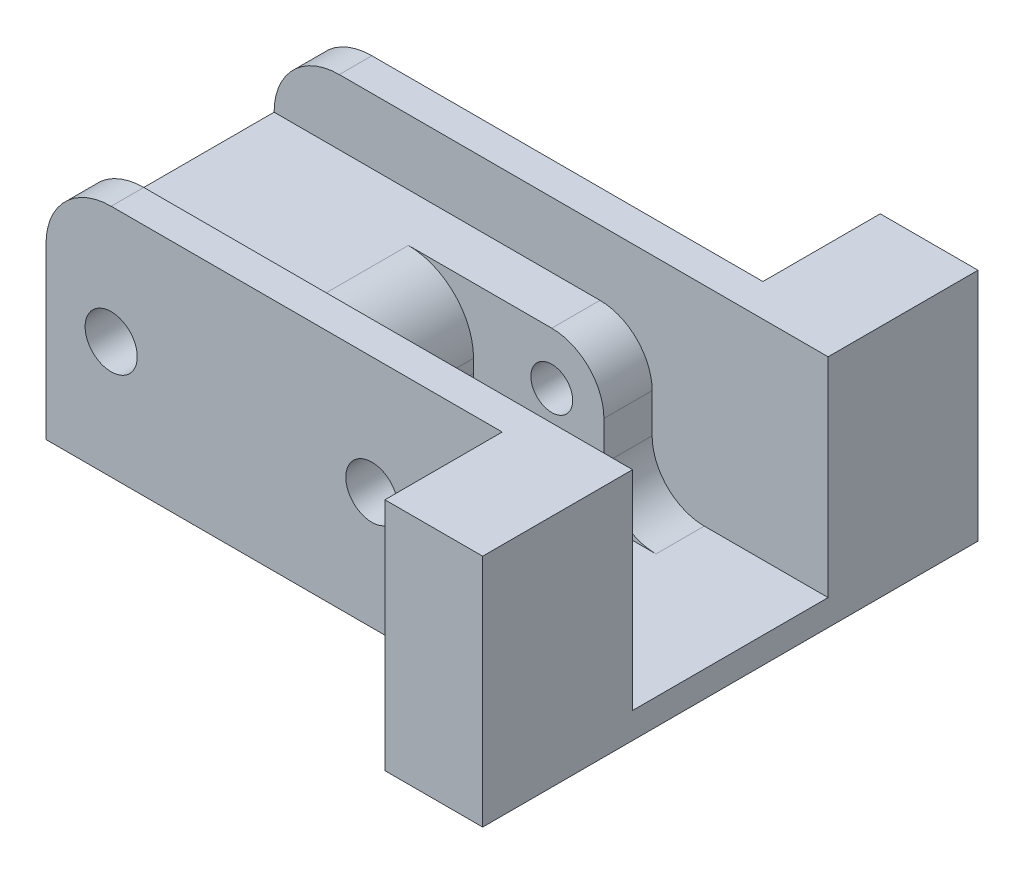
ISO-10303-21;
HEADER;
FILE_DESCRIPTION(('STEP AP214'),'2;1');
FILE_NAME('part.step','',(''),(''),'','','');
FILE_SCHEMA(('AUTOMOTIVE_DESIGN { 1 0 10303 214 1 1 1 1 }'));
ENDSEC;
DATA;
#1=APPLICATION_CONTEXT('core data for automotive mechanical design processes');
#2=APPLICATION_PROTOCOL_DEFINITION('international standard','automotive_design',2000,#1);
#3=PRODUCT_CONTEXT('',#1,'mechanical');
#4=PRODUCT('Part','Part','',(#3));
#5=PRODUCT_RELATED_PRODUCT_CATEGORY('part','',(#4));
#6=PRODUCT_DEFINITION_FORMATION('','',#4);
#7=PRODUCT_DEFINITION_CONTEXT('part definition',#1,'design');
#8=PRODUCT_DEFINITION('design','',#6,#7);
#9=PRODUCT_DEFINITION_SHAPE('','',#8);
#10=(LENGTH_UNIT() NAMED_UNIT(*) SI_UNIT(.MILLI.,.METRE.));
#11=(NAMED_UNIT(*) PLANE_ANGLE_UNIT() SI_UNIT($,.RADIAN.));
#12=(NAMED_UNIT(*) SI_UNIT($,.STERADIAN.) SOLID_ANGLE_UNIT());
#13=UNCERTAINTY_MEASURE_WITH_UNIT(LENGTH_MEASURE(1.E-05),#10,'distance_accuracy_value','');
#14=(GEOMETRIC_REPRESENTATION_CONTEXT(3) GLOBAL_UNCERTAINTY_ASSIGNED_CONTEXT((#13)) GLOBAL_UNIT_ASSIGNED_CONTEXT((#10,
#11,#12)) REPRESENTATION_CONTEXT('',''));
#15=CARTESIAN_POINT('',(0.,0.,0.));
#16=DIRECTION('',(0.,0.,1.));
#17=DIRECTION('',(1.,0.,0.));
#18=AXIS2_PLACEMENT_3D('',#15,#16,#17);
#19=CARTESIAN_POINT('',(0.,0.,10.));
#20=DIRECTION('',(0.,0.,-1.));
#21=DIRECTION('',(-1.,0.,0.));
#22=AXIS2_PLACEMENT_3D('',#19,#20,#21);
#23=CYLINDRICAL_SURFACE('',#22,1.605);
#24=CARTESIAN_POINT('',(0.,0.,5.));
#25=DIRECTION('',(0.,0.,1.));
#26=DIRECTION('',(1.,0.,0.));
#27=AXIS2_PLACEMENT_3D('',#24,#25,#26);
#28=CIRCLE('',#27,1.605);
#29=CARTESIAN_POINT('',(1.605,0.,5.));
#30=VERTEX_POINT('',#29);
#31=EDGE_CURVE('E421',#30,#30,#28,.T.);
#32=ORIENTED_EDGE('',*,*,#31,.T.);
#33=EDGE_LOOP('',(#32));
#34=FACE_BOUND('',#33,.T.);
#35=CARTESIAN_POINT('',(0.,0.,-5.));
#36=DIRECTION('',(0.,0.,-1.));
#37=DIRECTION('',(-1.,0.,0.));
#38=AXIS2_PLACEMENT_3D('',#35,#36,#37);
#39=CIRCLE('',#38,1.605);
#40=CARTESIAN_POINT('',(-1.605,0.,-5.));
#41=VERTEX_POINT('',#40);
#42=EDGE_CURVE('E47',#41,#41,#39,.T.);
#43=ORIENTED_EDGE('',*,*,#42,.T.);
#44=EDGE_LOOP('',(#43));
#45=FACE_BOUND('',#44,.T.);
#46=ADVANCED_FACE('F43',(#34,#45),#23,.F.);
#47=CARTESIAN_POINT('',(20.,0.,10.));
#48=DIRECTION('',(0.,0.,-1.));
#49=DIRECTION('',(-1.,0.,0.));
#50=AXIS2_PLACEMENT_3D('',#47,#48,#49);
#51=CYLINDRICAL_SURFACE('',#50,1.605);
#52=CARTESIAN_POINT('',(20.,0.,3.8));
#53=DIRECTION('',(0.,0.,1.));
#54=DIRECTION('',(1.,0.,0.));
#55=AXIS2_PLACEMENT_3D('',#52,#53,#54);
#56=CIRCLE('',#55,1.605);
#57=CARTESIAN_POINT('',(21.605,0.,3.8));
#58=VERTEX_POINT('',#57);
#59=EDGE_CURVE('E323',#58,#58,#56,.T.);
#60=ORIENTED_EDGE('',*,*,#59,.F.);
#61=EDGE_LOOP('',(#60));
#62=FACE_BOUND('',#61,.T.);
#63=CARTESIAN_POINT('',(20.,0.,5.));
#64=DIRECTION('',(0.,0.,1.));
#65=DIRECTION('',(1.,0.,0.));
#66=AXIS2_PLACEMENT_3D('',#63,#64,#65);
#67=CIRCLE('',#66,1.605);
#68=CARTESIAN_POINT('',(21.605,0.,5.));
#69=VERTEX_POINT('',#68);
#70=EDGE_CURVE('E233',#69,#69,#67,.T.);
#71=ORIENTED_EDGE('',*,*,#70,.T.);
#72=EDGE_LOOP('',(#71));
#73=FACE_BOUND('',#72,.T.);
#74=ADVANCED_FACE('F427',(#62,#73),#51,.F.);
#75=CARTESIAN_POINT('',(-5.,4.,10.));
#76=DIRECTION('',(0.,-1.,0.));
#77=DIRECTION('',(0.,0.,-1.));
#78=AXIS2_PLACEMENT_3D('',#75,#76,#77);
#79=PLANE('',#78);
#80=DIRECTION('',(1.,0.,0.));
#81=VECTOR('',#80,1.);
#82=CARTESIAN_POINT('',(37.5,4.,-7.5));
#83=LINE('',#82,#81);
#84=CARTESIAN_POINT('',(-5.,4.,-7.5));
#85=VERTEX_POINT('',#84);
#86=CARTESIAN_POINT('',(20.,4.,-7.5));
#87=VERTEX_POINT('',#86);
#88=EDGE_CURVE('E236',#85,#87,#83,.T.);
#89=ORIENTED_EDGE('',*,*,#88,.F.);
#90=DIRECTION('',(0.,0.,-1.));
#91=VECTOR('',#90,1.);
#92=CARTESIAN_POINT('',(-5.,4.,10.));
#93=LINE('',#92,#91);
#94=CARTESIAN_POINT('',(-5.,4.,7.5));
#95=VERTEX_POINT('',#94);
#96=EDGE_CURVE('E330',#95,#85,#93,.T.);
#97=ORIENTED_EDGE('',*,*,#96,.F.);
#98=DIRECTION('',(-1.,0.,0.));
#99=VECTOR('',#98,1.);
#100=CARTESIAN_POINT('',(37.5,4.,7.5));
#101=LINE('',#100,#99);
#102=CARTESIAN_POINT('',(20.,4.,7.5));
#103=VERTEX_POINT('',#102);
#104=EDGE_CURVE('E240',#103,#95,#101,.T.);
#105=ORIENTED_EDGE('',*,*,#104,.F.);
#106=DIRECTION('',(0.,0.,-1.));
#107=VECTOR('',#106,1.);
#108=CARTESIAN_POINT('',(20.,4.,10.));
#109=LINE('',#108,#107);
#110=CARTESIAN_POINT('',(20.,4.,3.8));
#111=VERTEX_POINT('',#110);
#112=EDGE_CURVE('E387',#103,#111,#109,.T.);
#113=ORIENTED_EDGE('',*,*,#112,.T.);
#114=DIRECTION('',(1.,0.,0.));
#115=VECTOR('',#114,1.);
#116=CARTESIAN_POINT('',(14.,4.,3.8));
#117=LINE('',#116,#115);
#118=CARTESIAN_POINT('',(9.,4.,3.8));
#119=VERTEX_POINT('',#118);
#120=EDGE_CURVE('E301',#119,#111,#117,.T.);
#121=ORIENTED_EDGE('',*,*,#120,.F.);
#122=DIRECTION('',(0.,0.,1.));
#123=VECTOR('',#122,1.);
#124=CARTESIAN_POINT('',(9.,4.,10.));
#125=LINE('',#124,#123);
#126=CARTESIAN_POINT('',(9.,4.,-3.8));
#127=VERTEX_POINT('',#126);
#128=EDGE_CURVE('E353',#119,#127,#125,.F.);
#129=ORIENTED_EDGE('',*,*,#128,.T.);
#130=DIRECTION('',(-1.,0.,0.));
#131=VECTOR('',#130,1.);
#132=CARTESIAN_POINT('',(14.,4.,-3.8));
#133=LINE('',#132,#131);
#134=CARTESIAN_POINT('',(20.,4.,-3.8));
#135=VERTEX_POINT('',#134);
#136=EDGE_CURVE('E296',#135,#127,#133,.T.);
#137=ORIENTED_EDGE('',*,*,#136,.F.);
#138=DIRECTION('',(0.,0.,-1.));
#139=VECTOR('',#138,1.);
#140=CARTESIAN_POINT('',(20.,4.,10.));
#141=LINE('',#140,#139);
#142=EDGE_CURVE('E390',#135,#87,#141,.T.);
#143=ORIENTED_EDGE('',*,*,#142,.T.);
#144=EDGE_LOOP('',(#89,#97,#105,#113,#121,#129,#137,#143));
#145=FACE_BOUND('',#144,.T.);
#146=ADVANCED_FACE('F472',(#145),#79,.F.);
#147=CARTESIAN_POINT('',(24.,-7.,10.));
#148=DIRECTION('',(0.,-1.,0.));
#149=DIRECTION('',(0.,0.,-1.));
#150=AXIS2_PLACEMENT_3D('',#147,#148,#149);
#151=PLANE('',#150);
#152=DIRECTION('',(1.,0.,0.));
#153=VECTOR('',#152,1.);
#154=CARTESIAN_POINT('',(14.,-7.,3.8));
#155=LINE('',#154,#153);
#156=CARTESIAN_POINT('',(19.,-7.,3.8));
#157=VERTEX_POINT('',#156);
#158=CARTESIAN_POINT('',(28.,-7.,3.8));
#159=VERTEX_POINT('',#158);
#160=EDGE_CURVE('E300',#157,#159,#155,.T.);
#161=ORIENTED_EDGE('',*,*,#160,.T.);
#162=DIRECTION('',(0.,0.,-1.));
#163=VECTOR('',#162,1.);
#164=CARTESIAN_POINT('',(28.,-7.,7.5));
#165=LINE('',#164,#163);
#166=CARTESIAN_POINT('',(28.,-7.,7.5));
#167=VERTEX_POINT('',#166);
#168=EDGE_CURVE('E376',#159,#167,#165,.F.);
#169=ORIENTED_EDGE('',*,*,#168,.T.);
#170=DIRECTION('',(-1.,0.,0.));
#171=VECTOR('',#170,1.);
#172=CARTESIAN_POINT('',(24.,-7.,7.5));
#173=LINE('',#172,#171);
#174=CARTESIAN_POINT('',(37.5,-7.,7.5));
#175=VERTEX_POINT('',#174);
#176=EDGE_CURVE('E285',#175,#167,#173,.T.);
#177=ORIENTED_EDGE('',*,*,#176,.F.);
#178=DIRECTION('',(0.,0.,-1.));
#179=VECTOR('',#178,1.);
#180=CARTESIAN_POINT('',(37.5,-7.,10.));
#181=LINE('',#180,#179);
#182=CARTESIAN_POINT('',(37.5,-7.,-7.5));
#183=VERTEX_POINT('',#182);
#184=EDGE_CURVE('E336',#175,#183,#181,.T.);
#185=ORIENTED_EDGE('',*,*,#184,.T.);
#186=DIRECTION('',(1.,0.,0.));
#187=VECTOR('',#186,1.);
#188=CARTESIAN_POINT('',(24.,-7.,-7.5));
#189=LINE('',#188,#187);
#190=CARTESIAN_POINT('',(28.,-7.,-7.5));
#191=VERTEX_POINT('',#190);
#192=EDGE_CURVE('E288',#191,#183,#189,.T.);
#193=ORIENTED_EDGE('',*,*,#192,.F.);
#194=DIRECTION('',(0.,0.,-1.));
#195=VECTOR('',#194,1.);
#196=CARTESIAN_POINT('',(28.,-7.,-3.8));
#197=LINE('',#196,#195);
#198=CARTESIAN_POINT('',(28.,-7.,-3.8));
#199=VERTEX_POINT('',#198);
#200=EDGE_CURVE('E373',#191,#199,#197,.F.);
#201=ORIENTED_EDGE('',*,*,#200,.T.);
#202=DIRECTION('',(-1.,0.,0.));
#203=VECTOR('',#202,1.);
#204=CARTESIAN_POINT('',(14.,-7.,-3.8));
#205=LINE('',#204,#203);
#206=CARTESIAN_POINT('',(19.,-7.,-3.8));
#207=VERTEX_POINT('',#206);
#208=EDGE_CURVE('E297',#199,#207,#205,.T.);
#209=ORIENTED_EDGE('',*,*,#208,.T.);
#210=DIRECTION('',(0.,0.,1.));
#211=VECTOR('',#210,1.);
#212=CARTESIAN_POINT('',(19.,-7.,3.8));
#213=LINE('',#212,#211);
#214=EDGE_CURVE('E356',#207,#157,#213,.T.);
#215=ORIENTED_EDGE('',*,*,#214,.T.);
#216=EDGE_LOOP('',(#161,#169,#177,#185,#193,#201,#209,#215));
#217=FACE_BOUND('',#216,.T.);
#218=ADVANCED_FACE('F499',(#217),#151,.F.);
#219=CARTESIAN_POINT('',(24.,4.,10.));
#220=DIRECTION('',(-1.,0.,0.));
#221=DIRECTION('',(0.,0.,1.));
#222=AXIS2_PLACEMENT_3D('',#219,#220,#221);
#223=PLANE('',#222);
#224=DIRECTION('',(0.,-1.,0.));
#225=VECTOR('',#224,1.);
#226=CARTESIAN_POINT('',(24.,4.,7.5));
#227=LINE('',#226,#225);
#228=CARTESIAN_POINT('',(24.,0.,7.5));
#229=VERTEX_POINT('',#228);
#230=CARTESIAN_POINT('',(24.,-3.,7.5));
#231=VERTEX_POINT('',#230);
#232=EDGE_CURVE('E282',#229,#231,#227,.T.);
#233=ORIENTED_EDGE('',*,*,#232,.T.);
#234=DIRECTION('',(0.,0.,-1.));
#235=VECTOR('',#234,1.);
#236=CARTESIAN_POINT('',(24.,-3.,3.8));
#237=LINE('',#236,#235);
#238=CARTESIAN_POINT('',(24.,-3.,3.8));
#239=VERTEX_POINT('',#238);
#240=EDGE_CURVE('E370',#231,#239,#237,.T.);
#241=ORIENTED_EDGE('',*,*,#240,.T.);
#242=DIRECTION('',(0.,1.,0.));
#243=VECTOR('',#242,1.);
#244=CARTESIAN_POINT('',(24.,-7.,3.8));
#245=LINE('',#244,#243);
#246=CARTESIAN_POINT('',(24.,0.,3.8));
#247=VERTEX_POINT('',#246);
#248=EDGE_CURVE('E307',#239,#247,#245,.T.);
#249=ORIENTED_EDGE('',*,*,#248,.T.);
#250=DIRECTION('',(0.,0.,-1.));
#251=VECTOR('',#250,1.);
#252=CARTESIAN_POINT('',(24.,0.,10.));
#253=LINE('',#252,#251);
#254=EDGE_CURVE('E368',#247,#229,#253,.F.);
#255=ORIENTED_EDGE('',*,*,#254,.T.);
#256=EDGE_LOOP('',(#233,#241,#249,#255));
#257=FACE_BOUND('',#256,.T.);
#258=ADVANCED_FACE('F506',(#257),#223,.F.);
#259=DIRECTION('',(0.,1.,0.));
#260=VECTOR('',#259,1.);
#261=CARTESIAN_POINT('',(24.,-7.,-3.8));
#262=LINE('',#261,#260);
#263=CARTESIAN_POINT('',(24.,-3.,-3.8));
#264=VERTEX_POINT('',#263);
#265=CARTESIAN_POINT('',(24.,0.,-3.8));
#266=VERTEX_POINT('',#265);
#267=EDGE_CURVE('E303',#264,#266,#262,.T.);
#268=ORIENTED_EDGE('',*,*,#267,.F.);
#269=DIRECTION('',(0.,0.,-1.));
#270=VECTOR('',#269,1.);
#271=CARTESIAN_POINT('',(24.,-3.,-7.5));
#272=LINE('',#271,#270);
#273=CARTESIAN_POINT('',(24.,-3.,-7.5));
#274=VERTEX_POINT('',#273);
#275=EDGE_CURVE('E382',#264,#274,#272,.T.);
#276=ORIENTED_EDGE('',*,*,#275,.T.);
#277=DIRECTION('',(0.,-1.,0.));
#278=VECTOR('',#277,1.);
#279=CARTESIAN_POINT('',(24.,4.,-7.5));
#280=LINE('',#279,#278);
#281=CARTESIAN_POINT('',(24.,0.,-7.5));
#282=VERTEX_POINT('',#281);
#283=EDGE_CURVE('E293',#282,#274,#280,.T.);
#284=ORIENTED_EDGE('',*,*,#283,.F.);
#285=DIRECTION('',(0.,0.,-1.));
#286=VECTOR('',#285,1.);
#287=CARTESIAN_POINT('',(24.,0.,10.));
#288=LINE('',#287,#286);
#289=EDGE_CURVE('E380',#282,#266,#288,.F.);
#290=ORIENTED_EDGE('',*,*,#289,.T.);
#291=EDGE_LOOP('',(#268,#276,#284,#290));
#292=FACE_BOUND('',#291,.T.);
#293=ADVANCED_FACE('F529',(#292),#223,.F.);
#294=CARTESIAN_POINT('',(0.,0.,10.));
#295=DIRECTION('',(0.,0.,-1.));
#296=DIRECTION('',(-1.,0.,0.));
#297=AXIS2_PLACEMENT_3D('',#294,#295,#296);
#298=PLANE('',#297);
#299=CARTESIAN_POINT('',(0.,0.,10.));
#300=DIRECTION('',(0.,0.,1.));
#301=DIRECTION('',(1.,0.,0.));
#302=AXIS2_PLACEMENT_3D('',#299,#300,#301);
#303=CIRCLE('',#302,2.);
#304=CARTESIAN_POINT('',(2.,0.,10.));
#305=VERTEX_POINT('',#304);
#306=EDGE_CURVE('E442',#305,#305,#303,.T.);
#307=ORIENTED_EDGE('',*,*,#306,.F.);
#308=EDGE_LOOP('',(#307));
#309=FACE_BOUND('',#308,.T.);
#310=CARTESIAN_POINT('',(20.,0.,10.));
#311=DIRECTION('',(0.,0.,1.));
#312=DIRECTION('',(1.,0.,0.));
#313=AXIS2_PLACEMENT_3D('',#310,#311,#312);
#314=CIRCLE('',#313,2.);
#315=CARTESIAN_POINT('',(22.,0.,10.));
#316=VERTEX_POINT('',#315);
#317=EDGE_CURVE('E439',#316,#316,#314,.T.);
#318=ORIENTED_EDGE('',*,*,#317,.F.);
#319=EDGE_LOOP('',(#318));
#320=FACE_BOUND('',#319,.T.);
#321=DIRECTION('',(1.,0.,0.));
#322=VECTOR('',#321,1.);
#323=CARTESIAN_POINT('',(-5.,9.,10.));
#324=LINE('',#323,#322);
#325=CARTESIAN_POINT('',(0.,9.,10.));
#326=VERTEX_POINT('',#325);
#327=CARTESIAN_POINT('',(30.,9.,10.));
#328=VERTEX_POINT('',#327);
#329=EDGE_CURVE('E252',#326,#328,#324,.T.);
#330=ORIENTED_EDGE('',*,*,#329,.F.);
#331=CARTESIAN_POINT('',(0.,4.,10.));
#332=DIRECTION('',(0.,0.,-1.));
#333=DIRECTION('',(-1.,0.,0.));
#334=AXIS2_PLACEMENT_3D('',#331,#332,#333);
#335=CIRCLE('',#334,5.);
#336=CARTESIAN_POINT('',(-5.,4.,10.));
#337=VERTEX_POINT('',#336);
#338=EDGE_CURVE('E410',#326,#337,#335,.F.);
#339=ORIENTED_EDGE('',*,*,#338,.T.);
#340=DIRECTION('',(0.,-1.,0.));
#341=VECTOR('',#340,1.);
#342=CARTESIAN_POINT('',(-5.,-9.,10.));
#343=LINE('',#342,#341);
#344=CARTESIAN_POINT('',(-5.,-9.,10.));
#345=VERTEX_POINT('',#344);
#346=EDGE_CURVE('E324',#337,#345,#343,.T.);
#347=ORIENTED_EDGE('',*,*,#346,.T.);
#348=DIRECTION('',(1.,0.,0.));
#349=VECTOR('',#348,1.);
#350=CARTESIAN_POINT('',(37.5,-9.,10.));
#351=LINE('',#350,#349);
#352=CARTESIAN_POINT('',(30.,-9.,10.));
#353=VERTEX_POINT('',#352);
#354=EDGE_CURVE('E326',#345,#353,#351,.T.);
#355=ORIENTED_EDGE('',*,*,#354,.T.);
#356=DIRECTION('',(0.,1.,0.));
#357=VECTOR('',#356,1.);
#358=CARTESIAN_POINT('',(30.,-9.,10.));
#359=LINE('',#358,#357);
#360=EDGE_CURVE('E263',#353,#328,#359,.T.);
#361=ORIENTED_EDGE('',*,*,#360,.T.);
#362=EDGE_LOOP('',(#330,#339,#347,#355,#361));
#363=FACE_BOUND('',#362,.T.);
#364=ADVANCED_FACE('F487',(#309,#320,#363),#298,.F.);
#365=CARTESIAN_POINT('',(0.,0.,-10.));
#366=DIRECTION('',(0.,0.,-1.));
#367=DIRECTION('',(-1.,0.,0.));
#368=AXIS2_PLACEMENT_3D('',#365,#366,#367);
#369=PLANE('',#368);
#370=CARTESIAN_POINT('',(0.,0.,-10.));
#371=DIRECTION('',(0.,0.,-1.));
#372=DIRECTION('',(-1.,0.,0.));
#373=AXIS2_PLACEMENT_3D('',#370,#371,#372);
#374=CIRCLE('',#373,2.);
#375=CARTESIAN_POINT('',(-2.,0.,-10.));
#376=VERTEX_POINT('',#375);
#377=EDGE_CURVE('E933',#376,#376,#374,.T.);
#378=ORIENTED_EDGE('',*,*,#377,.F.);
#379=EDGE_LOOP('',(#378));
#380=FACE_BOUND('',#379,.T.);
#381=DIRECTION('',(0.,-1.,0.));
#382=VECTOR('',#381,1.);
#383=CARTESIAN_POINT('',(-5.,-9.,-10.));
#384=LINE('',#383,#382);
#385=CARTESIAN_POINT('',(-5.,4.,-10.));
#386=VERTEX_POINT('',#385);
#387=CARTESIAN_POINT('',(-5.,-9.,-10.));
#388=VERTEX_POINT('',#387);
#389=EDGE_CURVE('E322',#386,#388,#384,.T.);
#390=ORIENTED_EDGE('',*,*,#389,.F.);
#391=CARTESIAN_POINT('',(0.,4.,-10.));
#392=DIRECTION('',(0.,0.,-1.));
#393=DIRECTION('',(-1.,0.,0.));
#394=AXIS2_PLACEMENT_3D('',#391,#392,#393);
#395=CIRCLE('',#394,5.);
#396=CARTESIAN_POINT('',(0.,9.,-10.));
#397=VERTEX_POINT('',#396);
#398=EDGE_CURVE('E11',#386,#397,#395,.T.);
#399=ORIENTED_EDGE('',*,*,#398,.T.);
#400=DIRECTION('',(-1.,0.,0.));
#401=VECTOR('',#400,1.);
#402=CARTESIAN_POINT('',(-5.,9.,-10.));
#403=LINE('',#402,#401);
#404=CARTESIAN_POINT('',(30.,9.,-10.));
#405=VERTEX_POINT('',#404);
#406=EDGE_CURVE('E237',#405,#397,#403,.T.);
#407=ORIENTED_EDGE('',*,*,#406,.F.);
#408=DIRECTION('',(0.,1.,0.));
#409=VECTOR('',#408,1.);
#410=CARTESIAN_POINT('',(30.,-9.,-10.));
#411=LINE('',#410,#409);
#412=CARTESIAN_POINT('',(30.,-9.,-10.));
#413=VERTEX_POINT('',#412);
#414=EDGE_CURVE('E223',#413,#405,#411,.T.);
#415=ORIENTED_EDGE('',*,*,#414,.F.);
#416=DIRECTION('',(1.,0.,0.));
#417=VECTOR('',#416,1.);
#418=CARTESIAN_POINT('',(37.5,-9.,-10.));
#419=LINE('',#418,#417);
#420=EDGE_CURVE('E327',#388,#413,#419,.T.);
#421=ORIENTED_EDGE('',*,*,#420,.F.);
#422=EDGE_LOOP('',(#390,#399,#407,#415,#421));
#423=FACE_BOUND('',#422,.T.);
#424=CARTESIAN_POINT('',(20.,0.,-10.));
#425=DIRECTION('',(0.,0.,1.));
#426=DIRECTION('',(1.,0.,0.));
#427=AXIS2_PLACEMENT_3D('',#424,#425,#426);
#428=CIRCLE('',#427,1.605);
#429=CARTESIAN_POINT('',(21.605,0.,-10.));
#430=VERTEX_POINT('',#429);
#431=EDGE_CURVE('E319',#430,#430,#428,.T.);
#432=ORIENTED_EDGE('',*,*,#431,.T.);
#433=EDGE_LOOP('',(#432));
#434=FACE_BOUND('',#433,.T.);
#435=ADVANCED_FACE('F463',(#380,#423,#434),#369,.T.);
#436=CARTESIAN_POINT('',(-5.,-9.,10.));
#437=DIRECTION('',(1.,0.,0.));
#438=DIRECTION('',(0.,1.,0.));
#439=AXIS2_PLACEMENT_3D('',#436,#437,#438);
#440=PLANE('',#439);
#441=ORIENTED_EDGE('',*,*,#346,.F.);
#442=DIRECTION('',(0.,0.,1.));
#443=VECTOR('',#442,1.);
#444=CARTESIAN_POINT('',(-5.,4.,7.5));
#445=LINE('',#444,#443);
#446=EDGE_CURVE('E414',#337,#95,#445,.F.);
#447=ORIENTED_EDGE('',*,*,#446,.T.);
#448=ORIENTED_EDGE('',*,*,#96,.T.);
#449=DIRECTION('',(0.,0.,1.));
#450=VECTOR('',#449,1.);
#451=CARTESIAN_POINT('',(-5.,4.,10.));
#452=LINE('',#451,#450);
#453=EDGE_CURVE('E412',#85,#386,#452,.F.);
#454=ORIENTED_EDGE('',*,*,#453,.T.);
#455=ORIENTED_EDGE('',*,*,#389,.T.);
#456=DIRECTION('',(0.,0.,-1.));
#457=VECTOR('',#456,1.);
#458=CARTESIAN_POINT('',(-5.,-9.,10.));
#459=LINE('',#458,#457);
#460=EDGE_CURVE('E341',#345,#388,#459,.T.);
#461=ORIENTED_EDGE('',*,*,#460,.F.);
#462=EDGE_LOOP('',(#441,#447,#448,#454,#455,#461));
#463=FACE_BOUND('',#462,.T.);
#464=ADVANCED_FACE('F467',(#463),#440,.F.);
#465=CARTESIAN_POINT('',(37.5,-9.,10.));
#466=DIRECTION('',(0.,1.,0.));
#467=DIRECTION('',(-1.,0.,0.));
#468=AXIS2_PLACEMENT_3D('',#465,#466,#467);
#469=PLANE('',#468);
#470=ORIENTED_EDGE('',*,*,#420,.T.);
#471=DIRECTION('',(0.,0.,1.));
#472=VECTOR('',#471,1.);
#473=CARTESIAN_POINT('',(30.,-9.,-10.));
#474=LINE('',#473,#472);
#475=CARTESIAN_POINT('',(30.,-9.,-19.));
#476=VERTEX_POINT('',#475);
#477=EDGE_CURVE('E276',#476,#413,#474,.T.);
#478=ORIENTED_EDGE('',*,*,#477,.F.);
#479=DIRECTION('',(-1.,0.,0.));
#480=VECTOR('',#479,1.);
#481=CARTESIAN_POINT('',(37.5,-9.,-19.));
#482=LINE('',#481,#480);
#483=CARTESIAN_POINT('',(37.5,-9.,-19.));
#484=VERTEX_POINT('',#483);
#485=EDGE_CURVE('E218',#484,#476,#482,.T.);
#486=ORIENTED_EDGE('',*,*,#485,.F.);
#487=DIRECTION('',(0.,0.,-1.));
#488=VECTOR('',#487,1.);
#489=CARTESIAN_POINT('',(37.5,-9.,10.));
#490=LINE('',#489,#488);
#491=CARTESIAN_POINT('',(37.5,-9.,19.));
#492=VERTEX_POINT('',#491);
#493=EDGE_CURVE('E339',#492,#484,#490,.T.);
#494=ORIENTED_EDGE('',*,*,#493,.F.);
#495=DIRECTION('',(1.,0.,0.));
#496=VECTOR('',#495,1.);
#497=CARTESIAN_POINT('',(37.5,-9.,19.));
#498=LINE('',#497,#496);
#499=CARTESIAN_POINT('',(30.,-9.,19.));
#500=VERTEX_POINT('',#499);
#501=EDGE_CURVE('E266',#500,#492,#498,.T.);
#502=ORIENTED_EDGE('',*,*,#501,.F.);
#503=DIRECTION('',(0.,0.,1.));
#504=VECTOR('',#503,1.);
#505=CARTESIAN_POINT('',(30.,-9.,10.));
#506=LINE('',#505,#504);
#507=EDGE_CURVE('E272',#353,#500,#506,.T.);
#508=ORIENTED_EDGE('',*,*,#507,.F.);
#509=ORIENTED_EDGE('',*,*,#354,.F.);
#510=ORIENTED_EDGE('',*,*,#460,.T.);
#511=EDGE_LOOP('',(#470,#478,#486,#494,#502,#508,#509,#510));
#512=FACE_BOUND('',#511,.T.);
#513=ADVANCED_FACE('F458',(#512),#469,.F.);
#514=CARTESIAN_POINT('',(37.5,-7.,10.));
#515=DIRECTION('',(-1.,0.,0.));
#516=DIRECTION('',(0.,0.,1.));
#517=AXIS2_PLACEMENT_3D('',#514,#515,#516);
#518=PLANE('',#517);
#519=ORIENTED_EDGE('',*,*,#493,.T.);
#520=DIRECTION('',(0.,1.,0.));
#521=VECTOR('',#520,1.);
#522=CARTESIAN_POINT('',(37.5,-9.,-19.));
#523=LINE('',#522,#521);
#524=CARTESIAN_POINT('',(37.5,9.,-19.));
#525=VERTEX_POINT('',#524);
#526=EDGE_CURVE('E224',#484,#525,#523,.T.);
#527=ORIENTED_EDGE('',*,*,#526,.T.);
#528=DIRECTION('',(0.,0.,-1.));
#529=VECTOR('',#528,1.);
#530=CARTESIAN_POINT('',(37.5,9.,-19.));
#531=LINE('',#530,#529);
#532=CARTESIAN_POINT('',(37.5,9.,-7.5));
#533=VERTEX_POINT('',#532);
#534=EDGE_CURVE('E232',#533,#525,#531,.T.);
#535=ORIENTED_EDGE('',*,*,#534,.F.);
#536=DIRECTION('',(0.,-1.,0.));
#537=VECTOR('',#536,1.);
#538=CARTESIAN_POINT('',(37.5,4.,-7.5));
#539=LINE('',#538,#537);
#540=EDGE_CURVE('E290',#533,#183,#539,.T.);
#541=ORIENTED_EDGE('',*,*,#540,.T.);
#542=ORIENTED_EDGE('',*,*,#184,.F.);
#543=DIRECTION('',(0.,-1.,0.));
#544=VECTOR('',#543,1.);
#545=CARTESIAN_POINT('',(37.5,4.,7.5));
#546=LINE('',#545,#544);
#547=CARTESIAN_POINT('',(37.5,9.,7.5));
#548=VERTEX_POINT('',#547);
#549=EDGE_CURVE('E278',#548,#175,#546,.T.);
#550=ORIENTED_EDGE('',*,*,#549,.F.);
#551=DIRECTION('',(0.,0.,-1.));
#552=VECTOR('',#551,1.);
#553=CARTESIAN_POINT('',(37.5,9.,19.));
#554=LINE('',#553,#552);
#555=CARTESIAN_POINT('',(37.5,9.,19.));
#556=VERTEX_POINT('',#555);
#557=EDGE_CURVE('E246',#556,#548,#554,.T.);
#558=ORIENTED_EDGE('',*,*,#557,.F.);
#559=DIRECTION('',(0.,1.,0.));
#560=VECTOR('',#559,1.);
#561=CARTESIAN_POINT('',(37.5,-9.,19.));
#562=LINE('',#561,#560);
#563=EDGE_CURVE('E260',#492,#556,#562,.T.);
#564=ORIENTED_EDGE('',*,*,#563,.F.);
#565=EDGE_LOOP('',(#519,#527,#535,#541,#542,#550,#558,#564));
#566=FACE_BOUND('',#565,.T.);
#567=ADVANCED_FACE('F455',(#566),#518,.F.);
#568=CARTESIAN_POINT('',(20.,0.,-3.8));
#569=DIRECTION('',(0.,0.,-1.));
#570=DIRECTION('',(-1.,0.,0.));
#571=AXIS2_PLACEMENT_3D('',#568,#569,#570);
#572=CIRCLE('',#571,1.605);
#573=CARTESIAN_POINT('',(18.395,0.,-3.8));
#574=VERTEX_POINT('',#573);
#575=EDGE_CURVE('E310',#574,#574,#572,.T.);
#576=ORIENTED_EDGE('',*,*,#575,.F.);
#577=EDGE_LOOP('',(#576));
#578=FACE_BOUND('',#577,.T.);
#579=ORIENTED_EDGE('',*,*,#431,.F.);
#580=EDGE_LOOP('',(#579));
#581=FACE_BOUND('',#580,.T.);
#582=ADVANCED_FACE('F564',(#578,#581),#51,.F.);
#583=CARTESIAN_POINT('',(14.,-7.,3.8));
#584=DIRECTION('',(0.,0.,1.));
#585=DIRECTION('',(1.,0.,0.));
#586=AXIS2_PLACEMENT_3D('',#583,#584,#585);
#587=PLANE('',#586);
#588=ORIENTED_EDGE('',*,*,#59,.T.);
#589=EDGE_LOOP('',(#588));
#590=FACE_BOUND('',#589,.T.);
#591=ORIENTED_EDGE('',*,*,#120,.T.);
#592=CARTESIAN_POINT('',(20.,0.,3.8));
#593=DIRECTION('',(0.,0.,1.));
#594=DIRECTION('',(1.,0.,0.));
#595=AXIS2_PLACEMENT_3D('',#592,#593,#594);
#596=CIRCLE('',#595,4.);
#597=EDGE_CURVE('E395',#111,#247,#596,.F.);
#598=ORIENTED_EDGE('',*,*,#597,.T.);
#599=ORIENTED_EDGE('',*,*,#248,.F.);
#600=CARTESIAN_POINT('',(28.,-3.,3.8));
#601=DIRECTION('',(0.,0.,1.));
#602=DIRECTION('',(1.,0.,0.));
#603=AXIS2_PLACEMENT_3D('',#600,#601,#602);
#604=CIRCLE('',#603,4.);
#605=EDGE_CURVE('E397',#239,#159,#604,.T.);
#606=ORIENTED_EDGE('',*,*,#605,.T.);
#607=ORIENTED_EDGE('',*,*,#160,.F.);
#608=CARTESIAN_POINT('',(19.,-2.,3.8));
#609=DIRECTION('',(0.,0.,1.));
#610=DIRECTION('',(1.,0.,0.));
#611=AXIS2_PLACEMENT_3D('',#608,#609,#610);
#612=CIRCLE('',#611,5.);
#613=CARTESIAN_POINT('',(14.,-2.,3.8));
#614=VERTEX_POINT('',#613);
#615=EDGE_CURVE('E359',#157,#614,#612,.F.);
#616=ORIENTED_EDGE('',*,*,#615,.T.);
#617=DIRECTION('',(0.,1.,0.));
#618=VECTOR('',#617,1.);
#619=CARTESIAN_POINT('',(14.,-7.,3.8));
#620=LINE('',#619,#618);
#621=CARTESIAN_POINT('',(14.,-1.,3.8));
#622=VERTEX_POINT('',#621);
#623=EDGE_CURVE('E311',#614,#622,#620,.T.);
#624=ORIENTED_EDGE('',*,*,#623,.T.);
#625=CARTESIAN_POINT('',(9.,-1.,3.8));
#626=DIRECTION('',(0.,0.,1.));
#627=DIRECTION('',(1.,0.,0.));
#628=AXIS2_PLACEMENT_3D('',#625,#626,#627);
#629=CIRCLE('',#628,5.);
#630=EDGE_CURVE('E363',#622,#119,#629,.T.);
#631=ORIENTED_EDGE('',*,*,#630,.T.);
#632=EDGE_LOOP('',(#591,#598,#599,#606,#607,#616,#624,#631));
#633=FACE_BOUND('',#632,.T.);
#634=ADVANCED_FACE('F512',(#590,#633),#587,.F.);
#635=CARTESIAN_POINT('',(14.,-7.,3.8));
#636=DIRECTION('',(-1.,0.,0.));
#637=DIRECTION('',(0.,0.,1.));
#638=AXIS2_PLACEMENT_3D('',#635,#636,#637);
#639=PLANE('',#638);
#640=DIRECTION('',(0.,1.,0.));
#641=VECTOR('',#640,1.);
#642=CARTESIAN_POINT('',(14.,-7.,-3.8));
#643=LINE('',#642,#641);
#644=CARTESIAN_POINT('',(14.,-2.,-3.8));
#645=VERTEX_POINT('',#644);
#646=CARTESIAN_POINT('',(14.,-1.,-3.8));
#647=VERTEX_POINT('',#646);
#648=EDGE_CURVE('E314',#645,#647,#643,.T.);
#649=ORIENTED_EDGE('',*,*,#648,.T.);
#650=DIRECTION('',(0.,0.,1.));
#651=VECTOR('',#650,1.);
#652=CARTESIAN_POINT('',(14.,-1.,3.8));
#653=LINE('',#652,#651);
#654=EDGE_CURVE('E350',#647,#622,#653,.T.);
#655=ORIENTED_EDGE('',*,*,#654,.T.);
#656=ORIENTED_EDGE('',*,*,#623,.F.);
#657=DIRECTION('',(0.,0.,1.));
#658=VECTOR('',#657,1.);
#659=CARTESIAN_POINT('',(14.,-2.,-3.8));
#660=LINE('',#659,#658);
#661=EDGE_CURVE('E344',#614,#645,#660,.F.);
#662=ORIENTED_EDGE('',*,*,#661,.T.);
#663=EDGE_LOOP('',(#649,#655,#656,#662));
#664=FACE_BOUND('',#663,.T.);
#665=ADVANCED_FACE('F541',(#664),#639,.F.);
#666=CARTESIAN_POINT('',(14.,-7.,-3.8));
#667=DIRECTION('',(0.,0.,-1.));
#668=DIRECTION('',(-1.,0.,0.));
#669=AXIS2_PLACEMENT_3D('',#666,#667,#668);
#670=PLANE('',#669);
#671=ORIENTED_EDGE('',*,*,#575,.T.);
#672=EDGE_LOOP('',(#671));
#673=FACE_BOUND('',#672,.T.);
#674=ORIENTED_EDGE('',*,*,#267,.T.);
#675=CARTESIAN_POINT('',(20.,0.,-3.8));
#676=DIRECTION('',(0.,0.,-1.));
#677=DIRECTION('',(-1.,0.,0.));
#678=AXIS2_PLACEMENT_3D('',#675,#676,#677);
#679=CIRCLE('',#678,4.);
#680=EDGE_CURVE('E393',#266,#135,#679,.F.);
#681=ORIENTED_EDGE('',*,*,#680,.T.);
#682=ORIENTED_EDGE('',*,*,#136,.T.);
#683=CARTESIAN_POINT('',(9.,-1.,-3.8));
#684=DIRECTION('',(0.,0.,-1.));
#685=DIRECTION('',(-1.,0.,0.));
#686=AXIS2_PLACEMENT_3D('',#683,#684,#685);
#687=CIRCLE('',#686,5.);
#688=EDGE_CURVE('E366',#127,#647,#687,.T.);
#689=ORIENTED_EDGE('',*,*,#688,.T.);
#690=ORIENTED_EDGE('',*,*,#648,.F.);
#691=CARTESIAN_POINT('',(19.,-2.,-3.8));
#692=DIRECTION('',(0.,0.,-1.));
#693=DIRECTION('',(-1.,0.,0.));
#694=AXIS2_PLACEMENT_3D('',#691,#692,#693);
#695=CIRCLE('',#694,5.);
#696=EDGE_CURVE('E361',#645,#207,#695,.F.);
#697=ORIENTED_EDGE('',*,*,#696,.T.);
#698=ORIENTED_EDGE('',*,*,#208,.F.);
#699=CARTESIAN_POINT('',(28.,-3.,-3.8));
#700=DIRECTION('',(0.,0.,-1.));
#701=DIRECTION('',(-1.,0.,0.));
#702=AXIS2_PLACEMENT_3D('',#699,#700,#701);
#703=CIRCLE('',#702,4.);
#704=EDGE_CURVE('E400',#199,#264,#703,.T.);
#705=ORIENTED_EDGE('',*,*,#704,.T.);
#706=EDGE_LOOP('',(#674,#681,#682,#689,#690,#697,#698,#705));
#707=FACE_BOUND('',#706,.T.);
#708=ADVANCED_FACE('F543',(#673,#707),#670,.F.);
#709=CARTESIAN_POINT('',(9.,-1.,3.8));
#710=DIRECTION('',(0.,0.,1.));
#711=DIRECTION('',(1.,0.,0.));
#712=AXIS2_PLACEMENT_3D('',#709,#710,#711);
#713=CYLINDRICAL_SURFACE('',#712,5.);
#714=ORIENTED_EDGE('',*,*,#688,.F.);
#715=ORIENTED_EDGE('',*,*,#128,.F.);
#716=ORIENTED_EDGE('',*,*,#630,.F.);
#717=ORIENTED_EDGE('',*,*,#654,.F.);
#718=EDGE_LOOP('',(#714,#715,#716,#717));
#719=FACE_BOUND('',#718,.T.);
#720=ADVANCED_FACE('F518',(#719),#713,.T.);
#721=CARTESIAN_POINT('',(19.,-2.,10.));
#722=DIRECTION('',(0.,0.,-1.));
#723=DIRECTION('',(-1.,0.,0.));
#724=AXIS2_PLACEMENT_3D('',#721,#722,#723);
#725=CYLINDRICAL_SURFACE('',#724,5.);
#726=ORIENTED_EDGE('',*,*,#696,.F.);
#727=ORIENTED_EDGE('',*,*,#661,.F.);
#728=ORIENTED_EDGE('',*,*,#615,.F.);
#729=ORIENTED_EDGE('',*,*,#214,.F.);
#730=EDGE_LOOP('',(#726,#727,#728,#729));
#731=FACE_BOUND('',#730,.T.);
#732=ADVANCED_FACE('F538',(#731),#725,.F.);
#733=CARTESIAN_POINT('',(24.,4.,-7.5));
#734=DIRECTION('',(0.,0.,-1.));
#735=DIRECTION('',(-1.,0.,0.));
#736=AXIS2_PLACEMENT_3D('',#733,#734,#735);
#737=PLANE('',#736);
#738=DIRECTION('',(1.,0.,0.));
#739=VECTOR('',#738,1.);
#740=CARTESIAN_POINT('',(37.5,9.,-7.5));
#741=LINE('',#740,#739);
#742=CARTESIAN_POINT('',(0.,9.,-7.5));
#743=VERTEX_POINT('',#742);
#744=EDGE_CURVE('E242',#743,#533,#741,.T.);
#745=ORIENTED_EDGE('',*,*,#744,.F.);
#746=CARTESIAN_POINT('',(0.,4.,-7.5));
#747=DIRECTION('',(0.,0.,-1.));
#748=DIRECTION('',(-1.,0.,0.));
#749=AXIS2_PLACEMENT_3D('',#746,#747,#748);
#750=CIRCLE('',#749,5.);
#751=EDGE_CURVE('E52',#743,#85,#750,.F.);
#752=ORIENTED_EDGE('',*,*,#751,.T.);
#753=ORIENTED_EDGE('',*,*,#88,.T.);
#754=CARTESIAN_POINT('',(20.,0.,-7.5));
#755=DIRECTION('',(0.,0.,-1.));
#756=DIRECTION('',(-1.,0.,0.));
#757=AXIS2_PLACEMENT_3D('',#754,#755,#756);
#758=CIRCLE('',#757,4.);
#759=EDGE_CURVE('E402',#87,#282,#758,.T.);
#760=ORIENTED_EDGE('',*,*,#759,.T.);
#761=ORIENTED_EDGE('',*,*,#283,.T.);
#762=CARTESIAN_POINT('',(28.,-3.,-7.5));
#763=DIRECTION('',(0.,0.,-1.));
#764=DIRECTION('',(-1.,0.,0.));
#765=AXIS2_PLACEMENT_3D('',#762,#763,#764);
#766=CIRCLE('',#765,4.);
#767=EDGE_CURVE('E385',#274,#191,#766,.F.);
#768=ORIENTED_EDGE('',*,*,#767,.T.);
#769=ORIENTED_EDGE('',*,*,#192,.T.);
#770=ORIENTED_EDGE('',*,*,#540,.F.);
#771=EDGE_LOOP('',(#745,#752,#753,#760,#761,#768,#769,#770));
#772=FACE_BOUND('',#771,.T.);
#773=ADVANCED_FACE('F451',(#772),#737,.F.);
#774=CARTESIAN_POINT('',(24.,4.,7.5));
#775=DIRECTION('',(0.,0.,1.));
#776=DIRECTION('',(1.,0.,0.));
#777=AXIS2_PLACEMENT_3D('',#774,#775,#776);
#778=PLANE('',#777);
#779=ORIENTED_EDGE('',*,*,#104,.T.);
#780=CARTESIAN_POINT('',(0.,4.,7.5));
#781=DIRECTION('',(0.,0.,1.));
#782=DIRECTION('',(1.,0.,0.));
#783=AXIS2_PLACEMENT_3D('',#780,#781,#782);
#784=CIRCLE('',#783,5.);
#785=CARTESIAN_POINT('',(0.,9.,7.5));
#786=VERTEX_POINT('',#785);
#787=EDGE_CURVE('E416',#95,#786,#784,.F.);
#788=ORIENTED_EDGE('',*,*,#787,.T.);
#789=DIRECTION('',(-1.,0.,0.));
#790=VECTOR('',#789,1.);
#791=CARTESIAN_POINT('',(37.5,9.,7.5));
#792=LINE('',#791,#790);
#793=EDGE_CURVE('E249',#548,#786,#792,.T.);
#794=ORIENTED_EDGE('',*,*,#793,.F.);
#795=ORIENTED_EDGE('',*,*,#549,.T.);
#796=ORIENTED_EDGE('',*,*,#176,.T.);
#797=CARTESIAN_POINT('',(28.,-3.,7.5));
#798=DIRECTION('',(0.,0.,1.));
#799=DIRECTION('',(1.,0.,0.));
#800=AXIS2_PLACEMENT_3D('',#797,#798,#799);
#801=CIRCLE('',#800,4.);
#802=EDGE_CURVE('E378',#167,#231,#801,.F.);
#803=ORIENTED_EDGE('',*,*,#802,.T.);
#804=ORIENTED_EDGE('',*,*,#232,.F.);
#805=CARTESIAN_POINT('',(20.,0.,7.5));
#806=DIRECTION('',(0.,0.,1.));
#807=DIRECTION('',(1.,0.,0.));
#808=AXIS2_PLACEMENT_3D('',#805,#806,#807);
#809=CIRCLE('',#808,4.);
#810=EDGE_CURVE('E404',#229,#103,#809,.T.);
#811=ORIENTED_EDGE('',*,*,#810,.T.);
#812=EDGE_LOOP('',(#779,#788,#794,#795,#796,#803,#804,#811));
#813=FACE_BOUND('',#812,.T.);
#814=ADVANCED_FACE('F475',(#813),#778,.F.);
#815=CARTESIAN_POINT('',(30.,-9.,-10.));
#816=DIRECTION('',(-1.,0.,0.));
#817=DIRECTION('',(0.,0.,1.));
#818=AXIS2_PLACEMENT_3D('',#815,#816,#817);
#819=PLANE('',#818);
#820=ORIENTED_EDGE('',*,*,#414,.T.);
#821=DIRECTION('',(0.,0.,1.));
#822=VECTOR('',#821,1.);
#823=CARTESIAN_POINT('',(30.,9.,-10.));
#824=LINE('',#823,#822);
#825=CARTESIAN_POINT('',(30.,9.,-19.));
#826=VERTEX_POINT('',#825);
#827=EDGE_CURVE('E230',#826,#405,#824,.T.);
#828=ORIENTED_EDGE('',*,*,#827,.F.);
#829=DIRECTION('',(0.,1.,0.));
#830=VECTOR('',#829,1.);
#831=CARTESIAN_POINT('',(30.,-9.,-19.));
#832=LINE('',#831,#830);
#833=EDGE_CURVE('E212',#476,#826,#832,.T.);
#834=ORIENTED_EDGE('',*,*,#833,.F.);
#835=ORIENTED_EDGE('',*,*,#477,.T.);
#836=EDGE_LOOP('',(#820,#828,#834,#835));
#837=FACE_BOUND('',#836,.T.);
#838=ADVANCED_FACE('F235',(#837),#819,.T.);
#839=CARTESIAN_POINT('',(37.5,-9.,-19.));
#840=DIRECTION('',(0.,0.,-1.));
#841=DIRECTION('',(-1.,0.,0.));
#842=AXIS2_PLACEMENT_3D('',#839,#840,#841);
#843=PLANE('',#842);
#844=ORIENTED_EDGE('',*,*,#833,.T.);
#845=DIRECTION('',(-1.,0.,0.));
#846=VECTOR('',#845,1.);
#847=CARTESIAN_POINT('',(30.,9.,-19.));
#848=LINE('',#847,#846);
#849=EDGE_CURVE('E216',#525,#826,#848,.T.);
#850=ORIENTED_EDGE('',*,*,#849,.F.);
#851=ORIENTED_EDGE('',*,*,#526,.F.);
#852=ORIENTED_EDGE('',*,*,#485,.T.);
#853=EDGE_LOOP('',(#844,#850,#851,#852));
#854=FACE_BOUND('',#853,.T.);
#855=ADVANCED_FACE('F214',(#854),#843,.T.);
#856=CARTESIAN_POINT('',(37.5,-9.,19.));
#857=DIRECTION('',(0.,0.,1.));
#858=DIRECTION('',(1.,0.,0.));
#859=AXIS2_PLACEMENT_3D('',#856,#857,#858);
#860=PLANE('',#859);
#861=ORIENTED_EDGE('',*,*,#563,.T.);
#862=DIRECTION('',(1.,0.,0.));
#863=VECTOR('',#862,1.);
#864=CARTESIAN_POINT('',(30.,9.,19.));
#865=LINE('',#864,#863);
#866=CARTESIAN_POINT('',(30.,9.,19.));
#867=VERTEX_POINT('',#866);
#868=EDGE_CURVE('E257',#867,#556,#865,.T.);
#869=ORIENTED_EDGE('',*,*,#868,.F.);
#870=DIRECTION('',(0.,1.,0.));
#871=VECTOR('',#870,1.);
#872=CARTESIAN_POINT('',(30.,-9.,19.));
#873=LINE('',#872,#871);
#874=EDGE_CURVE('E267',#500,#867,#873,.T.);
#875=ORIENTED_EDGE('',*,*,#874,.F.);
#876=ORIENTED_EDGE('',*,*,#501,.T.);
#877=EDGE_LOOP('',(#861,#869,#875,#876));
#878=FACE_BOUND('',#877,.T.);
#879=ADVANCED_FACE('F495',(#878),#860,.T.);
#880=CARTESIAN_POINT('',(30.,-9.,10.));
#881=DIRECTION('',(-1.,0.,0.));
#882=DIRECTION('',(0.,0.,1.));
#883=AXIS2_PLACEMENT_3D('',#880,#881,#882);
#884=PLANE('',#883);
#885=ORIENTED_EDGE('',*,*,#874,.T.);
#886=DIRECTION('',(0.,0.,1.));
#887=VECTOR('',#886,1.);
#888=CARTESIAN_POINT('',(30.,9.,10.));
#889=LINE('',#888,#887);
#890=EDGE_CURVE('E254',#328,#867,#889,.T.);
#891=ORIENTED_EDGE('',*,*,#890,.F.);
#892=ORIENTED_EDGE('',*,*,#360,.F.);
#893=ORIENTED_EDGE('',*,*,#507,.T.);
#894=EDGE_LOOP('',(#885,#891,#892,#893));
#895=FACE_BOUND('',#894,.T.);
#896=ADVANCED_FACE('F491',(#895),#884,.T.);
#897=CARTESIAN_POINT('',(28.,-3.,10.));
#898=DIRECTION('',(0.,0.,1.));
#899=DIRECTION('',(1.,0.,0.));
#900=AXIS2_PLACEMENT_3D('',#897,#898,#899);
#901=CYLINDRICAL_SURFACE('',#900,4.);
#902=ORIENTED_EDGE('',*,*,#802,.F.);
#903=ORIENTED_EDGE('',*,*,#168,.F.);
#904=ORIENTED_EDGE('',*,*,#605,.F.);
#905=ORIENTED_EDGE('',*,*,#240,.F.);
#906=EDGE_LOOP('',(#902,#903,#904,#905));
#907=FACE_BOUND('',#906,.T.);
#908=ADVANCED_FACE('F503',(#907),#901,.F.);
#909=CARTESIAN_POINT('',(28.,-3.,10.));
#910=DIRECTION('',(0.,0.,1.));
#911=DIRECTION('',(1.,0.,0.));
#912=AXIS2_PLACEMENT_3D('',#909,#910,#911);
#913=CYLINDRICAL_SURFACE('',#912,4.);
#914=ORIENTED_EDGE('',*,*,#704,.F.);
#915=ORIENTED_EDGE('',*,*,#200,.F.);
#916=ORIENTED_EDGE('',*,*,#767,.F.);
#917=ORIENTED_EDGE('',*,*,#275,.F.);
#918=EDGE_LOOP('',(#914,#915,#916,#917));
#919=FACE_BOUND('',#918,.T.);
#920=ADVANCED_FACE('F533',(#919),#913,.F.);
#921=CARTESIAN_POINT('',(20.,0.,10.));
#922=DIRECTION('',(0.,0.,-1.));
#923=DIRECTION('',(-1.,0.,0.));
#924=AXIS2_PLACEMENT_3D('',#921,#922,#923);
#925=CYLINDRICAL_SURFACE('',#924,4.);
#926=ORIENTED_EDGE('',*,*,#680,.F.);
#927=ORIENTED_EDGE('',*,*,#289,.F.);
#928=ORIENTED_EDGE('',*,*,#759,.F.);
#929=ORIENTED_EDGE('',*,*,#142,.F.);
#930=EDGE_LOOP('',(#926,#927,#928,#929));
#931=FACE_BOUND('',#930,.T.);
#932=ADVANCED_FACE('F524',(#931),#925,.T.);
#933=CARTESIAN_POINT('',(20.,0.,10.));
#934=DIRECTION('',(0.,0.,-1.));
#935=DIRECTION('',(-1.,0.,0.));
#936=AXIS2_PLACEMENT_3D('',#933,#934,#935);
#937=CYLINDRICAL_SURFACE('',#936,4.);
#938=ORIENTED_EDGE('',*,*,#810,.F.);
#939=ORIENTED_EDGE('',*,*,#254,.F.);
#940=ORIENTED_EDGE('',*,*,#597,.F.);
#941=ORIENTED_EDGE('',*,*,#112,.F.);
#942=EDGE_LOOP('',(#938,#939,#940,#941));
#943=FACE_BOUND('',#942,.T.);
#944=ADVANCED_FACE('F510',(#943),#937,.T.);
#945=CARTESIAN_POINT('',(0.,9.,0.));
#946=DIRECTION('',(0.,1.,0.));
#947=DIRECTION('',(0.,0.,1.));
#948=AXIS2_PLACEMENT_3D('',#945,#946,#947);
#949=PLANE('',#948);
#950=ORIENTED_EDGE('',*,*,#793,.T.);
#951=DIRECTION('',(0.,0.,1.));
#952=VECTOR('',#951,1.);
#953=CARTESIAN_POINT('',(0.,9.,10.));
#954=LINE('',#953,#952);
#955=EDGE_CURVE('E407',#786,#326,#954,.T.);
#956=ORIENTED_EDGE('',*,*,#955,.T.);
#957=ORIENTED_EDGE('',*,*,#329,.T.);
#958=ORIENTED_EDGE('',*,*,#890,.T.);
#959=ORIENTED_EDGE('',*,*,#868,.T.);
#960=ORIENTED_EDGE('',*,*,#557,.T.);
#961=EDGE_LOOP('',(#950,#956,#957,#958,#959,#960));
#962=FACE_BOUND('',#961,.T.);
#963=ADVANCED_FACE('F485',(#962),#949,.T.);
#964=CARTESIAN_POINT('',(0.,9.,0.));
#965=DIRECTION('',(0.,-1.,0.));
#966=DIRECTION('',(0.,0.,-1.));
#967=AXIS2_PLACEMENT_3D('',#964,#965,#966);
#968=PLANE('',#967);
#969=ORIENTED_EDGE('',*,*,#406,.T.);
#970=DIRECTION('',(0.,0.,1.));
#971=VECTOR('',#970,1.);
#972=CARTESIAN_POINT('',(0.,9.,0.));
#973=LINE('',#972,#971);
#974=EDGE_CURVE('E418',#397,#743,#973,.T.);
#975=ORIENTED_EDGE('',*,*,#974,.T.);
#976=ORIENTED_EDGE('',*,*,#744,.T.);
#977=ORIENTED_EDGE('',*,*,#534,.T.);
#978=ORIENTED_EDGE('',*,*,#849,.T.);
#979=ORIENTED_EDGE('',*,*,#827,.T.);
#980=EDGE_LOOP('',(#969,#975,#976,#977,#978,#979));
#981=FACE_BOUND('',#980,.T.);
#982=ADVANCED_FACE('F229',(#981),#968,.F.);
#983=CARTESIAN_POINT('',(0.,4.,0.));
#984=DIRECTION('',(0.,0.,-1.));
#985=DIRECTION('',(-1.,0.,0.));
#986=AXIS2_PLACEMENT_3D('',#983,#984,#985);
#987=CYLINDRICAL_SURFACE('',#986,5.);
#988=ORIENTED_EDGE('',*,*,#787,.F.);
#989=ORIENTED_EDGE('',*,*,#446,.F.);
#990=ORIENTED_EDGE('',*,*,#338,.F.);
#991=ORIENTED_EDGE('',*,*,#955,.F.);
#992=EDGE_LOOP('',(#988,#989,#990,#991));
#993=FACE_BOUND('',#992,.T.);
#994=ADVANCED_FACE('F482',(#993),#987,.T.);
#995=CARTESIAN_POINT('',(0.,4.,0.));
#996=DIRECTION('',(0.,0.,1.));
#997=DIRECTION('',(1.,0.,0.));
#998=AXIS2_PLACEMENT_3D('',#995,#996,#997);
#999=CYLINDRICAL_SURFACE('',#998,5.);
#1000=ORIENTED_EDGE('',*,*,#398,.F.);
#1001=ORIENTED_EDGE('',*,*,#453,.F.);
#1002=ORIENTED_EDGE('',*,*,#751,.F.);
#1003=ORIENTED_EDGE('',*,*,#974,.F.);
#1004=EDGE_LOOP('',(#1000,#1001,#1002,#1003));
#1005=FACE_BOUND('',#1004,.T.);
#1006=ADVANCED_FACE('F45',(#1005),#999,.T.);
#1007=CARTESIAN_POINT('',(0.,0.,5.));
#1008=DIRECTION('',(0.,0.,1.));
#1009=DIRECTION('',(1.,0.,0.));
#1010=AXIS2_PLACEMENT_3D('',#1007,#1008,#1009);
#1011=CYLINDRICAL_SURFACE('',#1010,2.);
#1012=CARTESIAN_POINT('',(0.,0.,5.));
#1013=DIRECTION('',(0.,0.,1.));
#1014=DIRECTION('',(1.,0.,0.));
#1015=AXIS2_PLACEMENT_3D('',#1012,#1013,#1014);
#1016=CIRCLE('',#1015,2.);
#1017=CARTESIAN_POINT('',(2.,0.,5.));
#1018=VERTEX_POINT('',#1017);
#1019=EDGE_CURVE('E423',#1018,#1018,#1016,.T.);
#1020=ORIENTED_EDGE('',*,*,#1019,.F.);
#1021=EDGE_LOOP('',(#1020));
#1022=FACE_BOUND('',#1021,.T.);
#1023=ORIENTED_EDGE('',*,*,#306,.T.);
#1024=EDGE_LOOP('',(#1023));
#1025=FACE_BOUND('',#1024,.T.);
#1026=ADVANCED_FACE('F597',(#1022,#1025),#1011,.F.);
#1027=CARTESIAN_POINT('',(0.,0.,5.));
#1028=DIRECTION('',(0.,0.,1.));
#1029=DIRECTION('',(1.,0.,0.));
#1030=AXIS2_PLACEMENT_3D('',#1027,#1028,#1029);
#1031=PLANE('',#1030);
#1032=ORIENTED_EDGE('',*,*,#31,.F.);
#1033=EDGE_LOOP('',(#1032));
#1034=FACE_BOUND('',#1033,.T.);
#1035=ORIENTED_EDGE('',*,*,#1019,.T.);
#1036=EDGE_LOOP('',(#1035));
#1037=FACE_BOUND('',#1036,.T.);
#1038=ADVANCED_FACE('F769',(#1034,#1037),#1031,.T.);
#1039=CARTESIAN_POINT('',(20.,0.,5.));
#1040=DIRECTION('',(0.,0.,1.));
#1041=DIRECTION('',(1.,0.,0.));
#1042=AXIS2_PLACEMENT_3D('',#1039,#1040,#1041);
#1043=CYLINDRICAL_SURFACE('',#1042,2.);
#1044=CARTESIAN_POINT('',(20.,0.,5.));
#1045=DIRECTION('',(0.,0.,1.));
#1046=DIRECTION('',(1.,0.,0.));
#1047=AXIS2_PLACEMENT_3D('',#1044,#1045,#1046);
#1048=CIRCLE('',#1047,2.);
#1049=CARTESIAN_POINT('',(22.,0.,5.));
#1050=VERTEX_POINT('',#1049);
#1051=EDGE_CURVE('E437',#1050,#1050,#1048,.T.);
#1052=ORIENTED_EDGE('',*,*,#1051,.F.);
#1053=EDGE_LOOP('',(#1052));
#1054=FACE_BOUND('',#1053,.T.);
#1055=ORIENTED_EDGE('',*,*,#317,.T.);
#1056=EDGE_LOOP('',(#1055));
#1057=FACE_BOUND('',#1056,.T.);
#1058=ADVANCED_FACE('F433',(#1054,#1057),#1043,.F.);
#1059=CARTESIAN_POINT('',(20.,0.,5.));
#1060=DIRECTION('',(0.,0.,1.));
#1061=DIRECTION('',(1.,0.,0.));
#1062=AXIS2_PLACEMENT_3D('',#1059,#1060,#1061);
#1063=PLANE('',#1062);
#1064=ORIENTED_EDGE('',*,*,#70,.F.);
#1065=EDGE_LOOP('',(#1064));
#1066=FACE_BOUND('',#1065,.T.);
#1067=ORIENTED_EDGE('',*,*,#1051,.T.);
#1068=EDGE_LOOP('',(#1067));
#1069=FACE_BOUND('',#1068,.T.);
#1070=ADVANCED_FACE('F429',(#1066,#1069),#1063,.T.);
#1071=CARTESIAN_POINT('',(0.,0.,-5.));
#1072=DIRECTION('',(0.,0.,-1.));
#1073=DIRECTION('',(-1.,0.,0.));
#1074=AXIS2_PLACEMENT_3D('',#1071,#1072,#1073);
#1075=CYLINDRICAL_SURFACE('',#1074,2.);
#1076=CARTESIAN_POINT('',(0.,0.,-5.));
#1077=DIRECTION('',(0.,0.,-1.));
#1078=DIRECTION('',(-1.,0.,0.));
#1079=AXIS2_PLACEMENT_3D('',#1076,#1077,#1078);
#1080=CIRCLE('',#1079,2.);
#1081=CARTESIAN_POINT('',(-2.,0.,-5.));
#1082=VERTEX_POINT('',#1081);
#1083=EDGE_CURVE('E445',#1082,#1082,#1080,.T.);
#1084=ORIENTED_EDGE('',*,*,#1083,.F.);
#1085=EDGE_LOOP('',(#1084));
#1086=FACE_BOUND('',#1085,.T.);
#1087=ORIENTED_EDGE('',*,*,#377,.T.);
#1088=EDGE_LOOP('',(#1087));
#1089=FACE_BOUND('',#1088,.T.);
#1090=ADVANCED_FACE('F432',(#1086,#1089),#1075,.F.);
#1091=CARTESIAN_POINT('',(0.,0.,-5.));
#1092=DIRECTION('',(0.,0.,-1.));
#1093=DIRECTION('',(-1.,0.,0.));
#1094=AXIS2_PLACEMENT_3D('',#1091,#1092,#1093);
#1095=PLANE('',#1094);
#1096=ORIENTED_EDGE('',*,*,#42,.F.);
#1097=EDGE_LOOP('',(#1096));
#1098=FACE_BOUND('',#1097,.T.);
#1099=ORIENTED_EDGE('',*,*,#1083,.T.);
#1100=EDGE_LOOP('',(#1099));
#1101=FACE_BOUND('',#1100,.T.);
#1102=ADVANCED_FACE('F801',(#1098,#1101),#1095,.T.);
#1103=CLOSED_SHELL('',(#46,#74,#146,#218,#258,#293,#364,#435,#464,#513,#567,#582,#634,#665,#708,
#720,#732,#773,#814,#838,#855,#879,#896,#908,#920,#932,#944,#963,#982,#994,#1006,#1026,#1038,
#1058,#1070,#1090,#1102));
#1104=MANIFOLD_SOLID_BREP('B2',#1103);
#1105=ADVANCED_BREP_SHAPE_REPRESENTATION('',(#18,#1104),#14);
#1106=SHAPE_DEFINITION_REPRESENTATION(#9,#1105);
ENDSEC;
END-ISO-10303-21;
